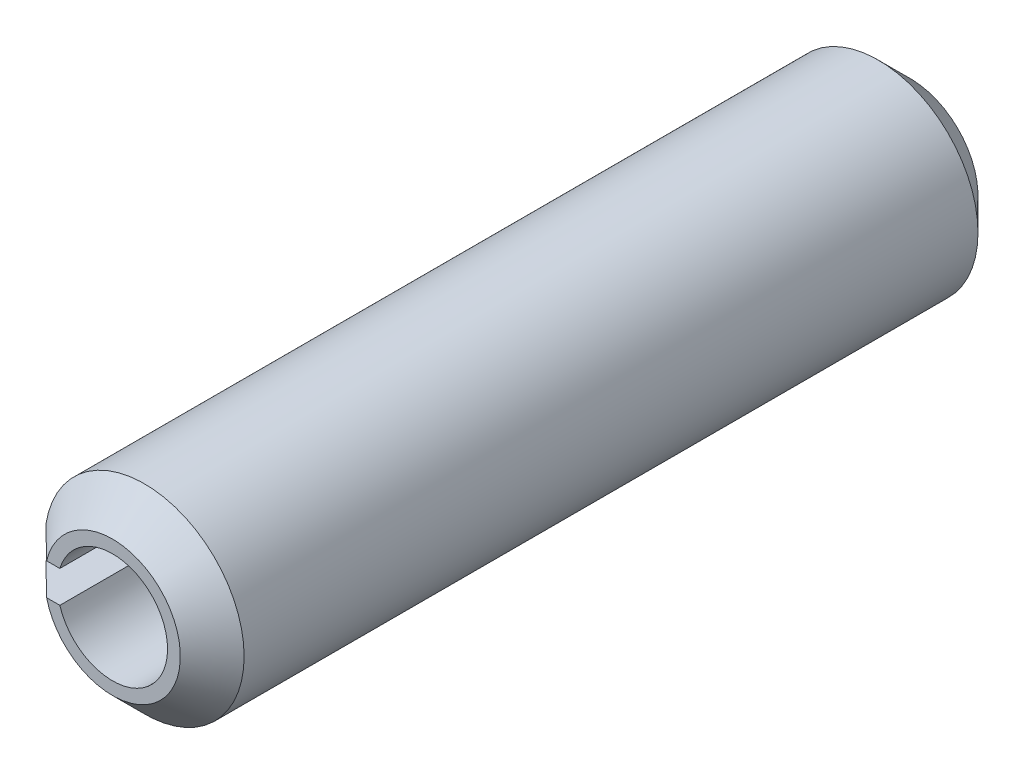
ISO-10303-21;
HEADER;
FILE_DESCRIPTION(('STEP AP214'),'2;1');
FILE_NAME('part.step','',(''),(''),'','','');
FILE_SCHEMA(('AUTOMOTIVE_DESIGN { 1 0 10303 214 1 1 1 1 }'));
ENDSEC;
DATA;
#1=APPLICATION_CONTEXT('core data for automotive mechanical design processes');
#2=APPLICATION_PROTOCOL_DEFINITION('international standard','automotive_design',2000,#1);
#3=PRODUCT_CONTEXT('',#1,'mechanical');
#4=PRODUCT('Part','Part','',(#3));
#5=PRODUCT_RELATED_PRODUCT_CATEGORY('part','',(#4));
#6=PRODUCT_DEFINITION_FORMATION('','',#4);
#7=PRODUCT_DEFINITION_CONTEXT('part definition',#1,'design');
#8=PRODUCT_DEFINITION('design','',#6,#7);
#9=PRODUCT_DEFINITION_SHAPE('','',#8);
#10=(LENGTH_UNIT() NAMED_UNIT(*) SI_UNIT(.MILLI.,.METRE.));
#11=(NAMED_UNIT(*) PLANE_ANGLE_UNIT() SI_UNIT($,.RADIAN.));
#12=(NAMED_UNIT(*) SI_UNIT($,.STERADIAN.) SOLID_ANGLE_UNIT());
#13=UNCERTAINTY_MEASURE_WITH_UNIT(LENGTH_MEASURE(1.E-05),#10,'distance_accuracy_value','');
#14=(GEOMETRIC_REPRESENTATION_CONTEXT(3) GLOBAL_UNCERTAINTY_ASSIGNED_CONTEXT((#13)) GLOBAL_UNIT_ASSIGNED_CONTEXT((#10,
#11,#12)) REPRESENTATION_CONTEXT('',''));
#15=CARTESIAN_POINT('',(0.,0.,0.));
#16=DIRECTION('',(0.,0.,1.));
#17=DIRECTION('',(1.,0.,0.));
#18=AXIS2_PLACEMENT_3D('',#15,#16,#17);
#19=CARTESIAN_POINT('',(0.,0.,6.35));
#20=DIRECTION('',(0.,0.,-1.));
#21=DIRECTION('',(-1.,0.,0.));
#22=AXIS2_PLACEMENT_3D('',#19,#20,#21);
#23=CYLINDRICAL_SURFACE('',#22,1.5875);
#24=DIRECTION('',(0.,0.,-1.));
#25=VECTOR('',#24,1.);
#26=CARTESIAN_POINT('',(-1.56704826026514,-0.254,6.35));
#27=LINE('',#26,#25);
#28=CARTESIAN_POINT('',(-1.56704826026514,-0.254,5.842));
#29=VERTEX_POINT('',#28);
#30=CARTESIAN_POINT('',(-1.56704826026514,-0.254,-5.842));
#31=VERTEX_POINT('',#30);
#32=EDGE_CURVE('E116',#29,#31,#27,.T.);
#33=ORIENTED_EDGE('',*,*,#32,.T.);
#34=CARTESIAN_POINT('',(0.,0.,-5.842));
#35=DIRECTION('',(0.,0.,1.));
#36=DIRECTION('',(1.,0.,0.));
#37=AXIS2_PLACEMENT_3D('',#34,#35,#36);
#38=CIRCLE('',#37,1.5875);
#39=CARTESIAN_POINT('',(-1.56704826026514,0.254,-5.842));
#40=VERTEX_POINT('',#39);
#41=EDGE_CURVE('E129',#31,#40,#38,.T.);
#42=ORIENTED_EDGE('',*,*,#41,.T.);
#43=DIRECTION('',(0.,0.,-1.));
#44=VECTOR('',#43,1.);
#45=CARTESIAN_POINT('',(-1.56704826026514,0.254,6.35));
#46=LINE('',#45,#44);
#47=CARTESIAN_POINT('',(-1.56704826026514,0.254,5.842));
#48=VERTEX_POINT('',#47);
#49=EDGE_CURVE('E109',#48,#40,#46,.T.);
#50=ORIENTED_EDGE('',*,*,#49,.F.);
#51=CARTESIAN_POINT('',(0.,0.,5.842));
#52=DIRECTION('',(0.,0.,1.));
#53=DIRECTION('',(1.,0.,0.));
#54=AXIS2_PLACEMENT_3D('',#51,#52,#53);
#55=CIRCLE('',#54,1.5875);
#56=EDGE_CURVE('E127',#48,#29,#55,.F.);
#57=ORIENTED_EDGE('',*,*,#56,.T.);
#58=EDGE_LOOP('',(#33,#42,#50,#57));
#59=FACE_BOUND('',#58,.T.);
#60=ADVANCED_FACE('F35',(#59),#23,.T.);
#61=CARTESIAN_POINT('',(-0.838680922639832,0.254,6.35));
#62=DIRECTION('',(0.,1.,0.));
#63=DIRECTION('',(0.,0.,1.));
#64=AXIS2_PLACEMENT_3D('',#61,#62,#63);
#65=PLANE('',#64);
#66=ORIENTED_EDGE('',*,*,#49,.T.);
#67=CARTESIAN_POINT('',(-1.56704826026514,0.254,-5.842));
#68=CARTESIAN_POINT('',(-1.52402515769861,0.254,-5.88446729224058));
#69=CARTESIAN_POINT('',(-1.48098119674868,0.254,-5.92691348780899));
#70=CARTESIAN_POINT('',(-1.39483530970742,0.254,-6.0117467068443));
#71=CARTESIAN_POINT('',(-1.35173338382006,0.254,-6.05413373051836));
#72=CARTESIAN_POINT('',(-1.26545493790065,0.254,-6.13883200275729));
#73=CARTESIAN_POINT('',(-1.22227841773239,0.254,-6.18114325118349));
#74=CARTESIAN_POINT('',(-1.13582098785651,0.254,-6.26565924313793));
#75=CARTESIAN_POINT('',(-1.09254007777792,0.254,-6.30786398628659));
#76=CARTESIAN_POINT('',(-1.049192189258,0.254,-6.35));
#77=B_SPLINE_CURVE_WITH_KNOTS('',3,(#67,#68,#69,#70,#71,#72,#73,#74,#75,#76),.UNSPECIFIED.,.F.,
.F.,(4,2,2,2,4),(0.,0.181356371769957,0.362712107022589,0.54406817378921,0.725424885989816),.UNSPECIFIED.);
#78=CARTESIAN_POINT('',(-1.049192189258,0.254,-6.35));
#79=VERTEX_POINT('',#78);
#80=EDGE_CURVE('E139',#40,#79,#77,.T.);
#81=ORIENTED_EDGE('',*,*,#80,.T.);
#82=DIRECTION('',(1.,0.,0.));
#83=VECTOR('',#82,1.);
#84=CARTESIAN_POINT('',(-0.838680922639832,0.254,-6.35));
#85=LINE('',#84,#83);
#86=CARTESIAN_POINT('',(-0.838680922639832,0.254,-6.35));
#87=VERTEX_POINT('',#86);
#88=EDGE_CURVE('E106',#79,#87,#85,.T.);
#89=ORIENTED_EDGE('',*,*,#88,.T.);
#90=DIRECTION('',(0.,0.,-1.));
#91=VECTOR('',#90,1.);
#92=CARTESIAN_POINT('',(-0.838680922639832,0.254,6.35));
#93=LINE('',#92,#91);
#94=CARTESIAN_POINT('',(-0.838680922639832,0.254,6.35));
#95=VERTEX_POINT('',#94);
#96=EDGE_CURVE('E103',#95,#87,#93,.T.);
#97=ORIENTED_EDGE('',*,*,#96,.F.);
#98=DIRECTION('',(1.,0.,0.));
#99=VECTOR('',#98,1.);
#100=CARTESIAN_POINT('',(-0.838680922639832,0.254,6.35));
#101=LINE('',#100,#99);
#102=CARTESIAN_POINT('',(-1.049192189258,0.254,6.35));
#103=VERTEX_POINT('',#102);
#104=EDGE_CURVE('E92',#103,#95,#101,.T.);
#105=ORIENTED_EDGE('',*,*,#104,.F.);
#106=CARTESIAN_POINT('',(-1.049192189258,0.254,6.35));
#107=CARTESIAN_POINT('',(-1.09254007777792,0.254,6.30786398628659));
#108=CARTESIAN_POINT('',(-1.13582098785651,0.254,6.26565924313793));
#109=CARTESIAN_POINT('',(-1.22227841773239,0.254,6.18114325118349));
#110=CARTESIAN_POINT('',(-1.26545493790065,0.254,6.13883200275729));
#111=CARTESIAN_POINT('',(-1.35173338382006,0.254,6.05413373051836));
#112=CARTESIAN_POINT('',(-1.39483530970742,0.254,6.0117467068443));
#113=CARTESIAN_POINT('',(-1.48098119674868,0.254,5.92691348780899));
#114=CARTESIAN_POINT('',(-1.52402515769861,0.254,5.88446729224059));
#115=CARTESIAN_POINT('',(-1.56704826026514,0.254,5.842));
#116=B_SPLINE_CURVE_WITH_KNOTS('',3,(#106,#107,#108,#109,#110,#111,#112,#113,#114,#115),
.UNSPECIFIED.,.F.,.F.,(4,2,2,2,4),(0.,0.181356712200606,0.362712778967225,0.544068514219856,
0.725424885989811),.UNSPECIFIED.);
#117=EDGE_CURVE('E132',#103,#48,#116,.T.);
#118=ORIENTED_EDGE('',*,*,#117,.T.);
#119=EDGE_LOOP('',(#66,#81,#89,#97,#105,#118));
#120=FACE_BOUND('',#119,.T.);
#121=ADVANCED_FACE('F105',(#120),#65,.F.);
#122=CARTESIAN_POINT('',(0.,0.,6.35));
#123=DIRECTION('',(0.,0.,-1.));
#124=DIRECTION('',(-1.,0.,0.));
#125=AXIS2_PLACEMENT_3D('',#122,#123,#124);
#126=CYLINDRICAL_SURFACE('',#125,0.8763);
#127=CARTESIAN_POINT('',(0.,0.,-6.35));
#128=DIRECTION('',(0.,0.,-1.));
#129=DIRECTION('',(1.,0.,0.));
#130=AXIS2_PLACEMENT_3D('',#127,#128,#129);
#131=CIRCLE('',#130,0.8763);
#132=CARTESIAN_POINT('',(-0.838680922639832,-0.254,-6.35));
#133=VERTEX_POINT('',#132);
#134=EDGE_CURVE('E120',#87,#133,#131,.T.);
#135=ORIENTED_EDGE('',*,*,#134,.T.);
#136=DIRECTION('',(0.,0.,-1.));
#137=VECTOR('',#136,1.);
#138=CARTESIAN_POINT('',(-0.838680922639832,-0.254,6.35));
#139=LINE('',#138,#137);
#140=CARTESIAN_POINT('',(-0.838680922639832,-0.254,6.35));
#141=VERTEX_POINT('',#140);
#142=EDGE_CURVE('E110',#141,#133,#139,.T.);
#143=ORIENTED_EDGE('',*,*,#142,.F.);
#144=CARTESIAN_POINT('',(0.,0.,6.35));
#145=DIRECTION('',(0.,0.,-1.));
#146=DIRECTION('',(1.,0.,0.));
#147=AXIS2_PLACEMENT_3D('',#144,#145,#146);
#148=CIRCLE('',#147,0.8763);
#149=EDGE_CURVE('E96',#95,#141,#148,.T.);
#150=ORIENTED_EDGE('',*,*,#149,.F.);
#151=ORIENTED_EDGE('',*,*,#96,.T.);
#152=EDGE_LOOP('',(#135,#143,#150,#151));
#153=FACE_BOUND('',#152,.T.);
#154=ADVANCED_FACE('F112',(#153),#126,.F.);
#155=CARTESIAN_POINT('',(-0.838680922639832,-0.254,6.35));
#156=DIRECTION('',(0.,-1.,0.));
#157=DIRECTION('',(0.,0.,-1.));
#158=AXIS2_PLACEMENT_3D('',#155,#156,#157);
#159=PLANE('',#158);
#160=DIRECTION('',(-1.,0.,0.));
#161=VECTOR('',#160,1.);
#162=CARTESIAN_POINT('',(-0.838680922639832,-0.254,-6.35));
#163=LINE('',#162,#161);
#164=CARTESIAN_POINT('',(-1.049192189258,-0.254,-6.35));
#165=VERTEX_POINT('',#164);
#166=EDGE_CURVE('E100',#133,#165,#163,.T.);
#167=ORIENTED_EDGE('',*,*,#166,.T.);
#168=CARTESIAN_POINT('',(-1.049192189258,-0.254,-6.35));
#169=CARTESIAN_POINT('',(-1.09254007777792,-0.254,-6.30786398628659));
#170=CARTESIAN_POINT('',(-1.13582098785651,-0.254,-6.26565924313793));
#171=CARTESIAN_POINT('',(-1.22227841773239,-0.254,-6.18114325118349));
#172=CARTESIAN_POINT('',(-1.26545493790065,-0.254,-6.13883200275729));
#173=CARTESIAN_POINT('',(-1.35173338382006,-0.254,-6.05413373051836));
#174=CARTESIAN_POINT('',(-1.39483530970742,-0.254,-6.0117467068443));
#175=CARTESIAN_POINT('',(-1.48098119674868,-0.254,-5.92691348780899));
#176=CARTESIAN_POINT('',(-1.52402515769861,-0.254,-5.88446729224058));
#177=CARTESIAN_POINT('',(-1.56704826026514,-0.254,-5.842));
#178=B_SPLINE_CURVE_WITH_KNOTS('',3,(#168,#169,#170,#171,#172,#173,#174,#175,#176,#177),
.UNSPECIFIED.,.F.,.F.,(4,2,2,2,4),(0.,0.181356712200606,0.362712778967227,0.544068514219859,
0.725424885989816),.UNSPECIFIED.);
#179=EDGE_CURVE('E44',#165,#31,#178,.T.);
#180=ORIENTED_EDGE('',*,*,#179,.T.);
#181=ORIENTED_EDGE('',*,*,#32,.F.);
#182=CARTESIAN_POINT('',(-1.56704826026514,-0.254,5.842));
#183=CARTESIAN_POINT('',(-1.52402515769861,-0.254,5.88446729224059));
#184=CARTESIAN_POINT('',(-1.48098119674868,-0.254,5.92691348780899));
#185=CARTESIAN_POINT('',(-1.39483530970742,-0.254,6.0117467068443));
#186=CARTESIAN_POINT('',(-1.35173338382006,-0.254,6.05413373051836));
#187=CARTESIAN_POINT('',(-1.26545493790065,-0.254,6.13883200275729));
#188=CARTESIAN_POINT('',(-1.22227841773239,-0.254,6.18114325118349));
#189=CARTESIAN_POINT('',(-1.13582098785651,-0.254,6.26565924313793));
#190=CARTESIAN_POINT('',(-1.09254007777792,-0.254,6.30786398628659));
#191=CARTESIAN_POINT('',(-1.049192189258,-0.254,6.35));
#192=B_SPLINE_CURVE_WITH_KNOTS('',3,(#182,#183,#184,#185,#186,#187,#188,#189,#190,#191),
.UNSPECIFIED.,.F.,.F.,(4,2,2,2,4),(0.,0.181356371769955,0.362712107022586,0.544068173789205,
0.725424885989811),.UNSPECIFIED.);
#193=CARTESIAN_POINT('',(-1.049192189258,-0.254,6.35));
#194=VERTEX_POINT('',#193);
#195=EDGE_CURVE('E51',#29,#194,#192,.T.);
#196=ORIENTED_EDGE('',*,*,#195,.T.);
#197=DIRECTION('',(-1.,0.,0.));
#198=VECTOR('',#197,1.);
#199=CARTESIAN_POINT('',(-0.838680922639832,-0.254,6.35));
#200=LINE('',#199,#198);
#201=EDGE_CURVE('E114',#141,#194,#200,.T.);
#202=ORIENTED_EDGE('',*,*,#201,.F.);
#203=ORIENTED_EDGE('',*,*,#142,.T.);
#204=EDGE_LOOP('',(#167,#180,#181,#196,#202,#203));
#205=FACE_BOUND('',#204,.T.);
#206=ADVANCED_FACE('F168',(#205),#159,.F.);
#207=CARTESIAN_POINT('',(0.,0.,6.35));
#208=DIRECTION('',(0.,0.,1.));
#209=DIRECTION('',(1.,0.,0.));
#210=AXIS2_PLACEMENT_3D('',#207,#208,#209);
#211=PLANE('',#210);
#212=ORIENTED_EDGE('',*,*,#201,.T.);
#213=CARTESIAN_POINT('',(0.,0.,6.35));
#214=DIRECTION('',(0.,0.,1.));
#215=DIRECTION('',(1.,0.,0.));
#216=AXIS2_PLACEMENT_3D('',#213,#214,#215);
#217=CIRCLE('',#216,1.0795);
#218=EDGE_CURVE('E11',#194,#103,#217,.T.);
#219=ORIENTED_EDGE('',*,*,#218,.T.);
#220=ORIENTED_EDGE('',*,*,#104,.T.);
#221=ORIENTED_EDGE('',*,*,#149,.T.);
#222=EDGE_LOOP('',(#212,#219,#220,#221));
#223=FACE_BOUND('',#222,.T.);
#224=ADVANCED_FACE('F94',(#223),#211,.T.);
#225=CARTESIAN_POINT('',(0.,0.,-6.35));
#226=DIRECTION('',(0.,0.,1.));
#227=DIRECTION('',(1.,0.,0.));
#228=AXIS2_PLACEMENT_3D('',#225,#226,#227);
#229=PLANE('',#228);
#230=ORIENTED_EDGE('',*,*,#88,.F.);
#231=CARTESIAN_POINT('',(0.,0.,-6.35));
#232=DIRECTION('',(0.,0.,1.));
#233=DIRECTION('',(1.,0.,0.));
#234=AXIS2_PLACEMENT_3D('',#231,#232,#233);
#235=CIRCLE('',#234,1.0795);
#236=EDGE_CURVE('E59',#79,#165,#235,.F.);
#237=ORIENTED_EDGE('',*,*,#236,.T.);
#238=ORIENTED_EDGE('',*,*,#166,.F.);
#239=ORIENTED_EDGE('',*,*,#134,.F.);
#240=EDGE_LOOP('',(#230,#237,#238,#239));
#241=FACE_BOUND('',#240,.T.);
#242=ADVANCED_FACE('F156',(#241),#229,.F.);
#243=CARTESIAN_POINT('',(0.,0.,-5.842));
#244=DIRECTION('',(0.,0.,1.));
#245=DIRECTION('',(1.,0.,0.));
#246=AXIS2_PLACEMENT_3D('',#243,#244,#245);
#247=CONICAL_SURFACE('',#246,1.5875,0.78539816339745);
#248=ORIENTED_EDGE('',*,*,#179,.F.);
#249=ORIENTED_EDGE('',*,*,#236,.F.);
#250=ORIENTED_EDGE('',*,*,#80,.F.);
#251=ORIENTED_EDGE('',*,*,#41,.F.);
#252=EDGE_LOOP('',(#248,#249,#250,#251));
#253=FACE_BOUND('',#252,.T.);
#254=ADVANCED_FACE('F153',(#253),#247,.T.);
#255=CARTESIAN_POINT('',(0.,0.,6.35));
#256=DIRECTION('',(0.,0.,-1.));
#257=DIRECTION('',(-1.,0.,0.));
#258=AXIS2_PLACEMENT_3D('',#255,#256,#257);
#259=CONICAL_SURFACE('',#258,1.0795,0.785398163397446);
#260=ORIENTED_EDGE('',*,*,#195,.F.);
#261=ORIENTED_EDGE('',*,*,#56,.F.);
#262=ORIENTED_EDGE('',*,*,#117,.F.);
#263=ORIENTED_EDGE('',*,*,#218,.F.);
#264=EDGE_LOOP('',(#260,#261,#262,#263));
#265=FACE_BOUND('',#264,.T.);
#266=ADVANCED_FACE('F37',(#265),#259,.T.);
#267=CLOSED_SHELL('',(#60,#121,#154,#206,#224,#242,#254,#266));
#268=MANIFOLD_SOLID_BREP('B2',#267);
#269=ADVANCED_BREP_SHAPE_REPRESENTATION('',(#18,#268),#14);
#270=SHAPE_DEFINITION_REPRESENTATION(#9,#269);
ENDSEC;
END-ISO-10303-21;
